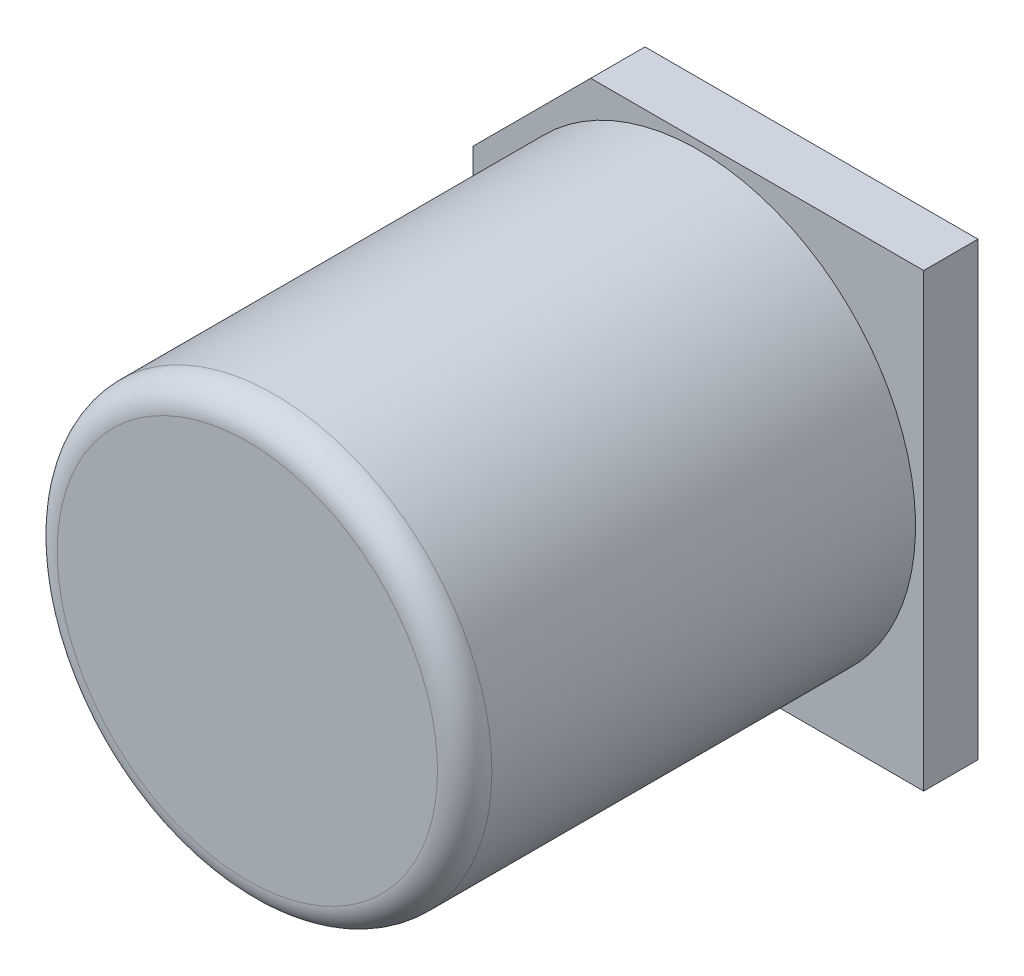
from build123d import *

# Parameters (mm, degrees)
BOSS_EXTRUDE1_DEPTH = 1
SKETCH3_R           = 4
BOSS_EXTRUDE2_DEPTH = 8.3
FILLET2_R           = 0.5


with BuildPart() as part:
    # Sketch2 → Boss-Extrude1 (new body)
    with BuildSketch(Plane.XY):
        Polygon((-1.98, 4.15), (-4.15, 1.98), (-4.15, -1.98), (-1.98, -4.15), (4.15, -4.15), (4.15, 4.15), align=None)
    extrude(amount=BOSS_EXTRUDE1_DEPTH)

    # Sketch3 → Boss-Extrude2 (add)
    with BuildSketch(Plane.XY.offset(1)):
        with Locations(Location((0, 0, 0), (0, 0, 180))):
            Circle(SKETCH3_R)
    extrude(amount=BOSS_EXTRUDE2_DEPTH)

    # Fillet2
    fillet2_edges = [part.edges().sort_by_distance(p)[0] for p in [
        (4, 0, 9.3),
    ]]
    fillet(fillet2_edges, radius=FILLET2_R)


solid = part.part
